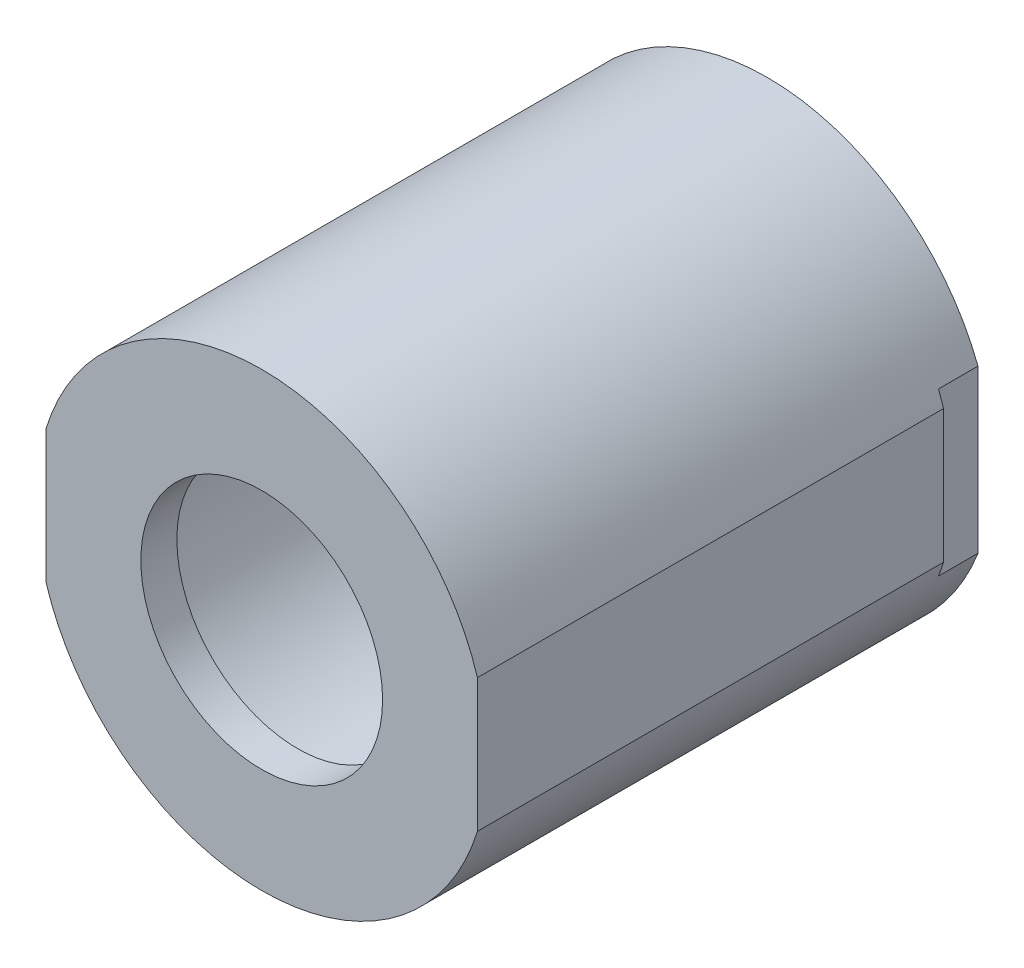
ISO-10303-21;
HEADER;
FILE_DESCRIPTION(('STEP AP214'),'2;1');
FILE_NAME('part.step','',(''),(''),'','','');
FILE_SCHEMA(('AUTOMOTIVE_DESIGN { 1 0 10303 214 1 1 1 1 }'));
ENDSEC;
DATA;
#1=APPLICATION_CONTEXT('core data for automotive mechanical design processes');
#2=APPLICATION_PROTOCOL_DEFINITION('international standard','automotive_design',2000,#1);
#3=PRODUCT_CONTEXT('',#1,'mechanical');
#4=PRODUCT('Part','Part','',(#3));
#5=PRODUCT_RELATED_PRODUCT_CATEGORY('part','',(#4));
#6=PRODUCT_DEFINITION_FORMATION('','',#4);
#7=PRODUCT_DEFINITION_CONTEXT('part definition',#1,'design');
#8=PRODUCT_DEFINITION('design','',#6,#7);
#9=PRODUCT_DEFINITION_SHAPE('','',#8);
#10=(LENGTH_UNIT() NAMED_UNIT(*) SI_UNIT(.MILLI.,.METRE.));
#11=(NAMED_UNIT(*) PLANE_ANGLE_UNIT() SI_UNIT($,.RADIAN.));
#12=(NAMED_UNIT(*) SI_UNIT($,.STERADIAN.) SOLID_ANGLE_UNIT());
#13=UNCERTAINTY_MEASURE_WITH_UNIT(LENGTH_MEASURE(1.E-05),#10,'distance_accuracy_value','');
#14=(GEOMETRIC_REPRESENTATION_CONTEXT(3) GLOBAL_UNCERTAINTY_ASSIGNED_CONTEXT((#13)) GLOBAL_UNIT_ASSIGNED_CONTEXT((#10,
#11,#12)) REPRESENTATION_CONTEXT('',''));
#15=CARTESIAN_POINT('',(0.,0.,0.));
#16=DIRECTION('',(0.,0.,1.));
#17=DIRECTION('',(1.,0.,0.));
#18=AXIS2_PLACEMENT_3D('',#15,#16,#17);
#19=CARTESIAN_POINT('',(27.305,-8.42422696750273,64.));
#20=DIRECTION('',(-1.,0.,0.));
#21=DIRECTION('',(0.,0.,1.));
#22=AXIS2_PLACEMENT_3D('',#19,#20,#21);
#23=PLANE('',#22);
#24=DIRECTION('',(0.,-1.,0.));
#25=VECTOR('',#24,1.);
#26=CARTESIAN_POINT('',(27.305,-8.42422696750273,5.));
#27=LINE('',#26,#25);
#28=CARTESIAN_POINT('',(27.305,8.42422696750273,5.));
#29=VERTEX_POINT('',#28);
#30=CARTESIAN_POINT('',(27.305,-8.42422696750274,5.));
#31=VERTEX_POINT('',#30);
#32=EDGE_CURVE('E11',#29,#31,#27,.T.);
#33=ORIENTED_EDGE('',*,*,#32,.F.);
#34=DIRECTION('',(0.,0.,-1.));
#35=VECTOR('',#34,1.);
#36=CARTESIAN_POINT('',(27.305,8.42422696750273,64.));
#37=LINE('',#36,#35);
#38=CARTESIAN_POINT('',(27.305,8.42422696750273,64.));
#39=VERTEX_POINT('',#38);
#40=EDGE_CURVE('E149',#39,#29,#37,.T.);
#41=ORIENTED_EDGE('',*,*,#40,.F.);
#42=DIRECTION('',(0.,1.,0.));
#43=VECTOR('',#42,1.);
#44=CARTESIAN_POINT('',(27.305,-8.42422696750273,64.));
#45=LINE('',#44,#43);
#46=CARTESIAN_POINT('',(27.305,-8.42422696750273,64.));
#47=VERTEX_POINT('',#46);
#48=EDGE_CURVE('E143',#47,#39,#45,.T.);
#49=ORIENTED_EDGE('',*,*,#48,.F.);
#50=DIRECTION('',(0.,0.,-1.));
#51=VECTOR('',#50,1.);
#52=CARTESIAN_POINT('',(27.305,-8.42422696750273,64.));
#53=LINE('',#52,#51);
#54=EDGE_CURVE('E148',#47,#31,#53,.T.);
#55=ORIENTED_EDGE('',*,*,#54,.T.);
#56=EDGE_LOOP('',(#33,#41,#49,#55));
#57=FACE_BOUND('',#56,.T.);
#58=ADVANCED_FACE('F35',(#57),#23,.F.);
#59=CARTESIAN_POINT('',(-27.305,-8.42422696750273,64.));
#60=DIRECTION('',(1.,0.,0.));
#61=DIRECTION('',(0.,0.,-1.));
#62=AXIS2_PLACEMENT_3D('',#59,#60,#61);
#63=PLANE('',#62);
#64=DIRECTION('',(0.,1.,0.));
#65=VECTOR('',#64,1.);
#66=CARTESIAN_POINT('',(-27.305,-8.42422696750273,5.));
#67=LINE('',#66,#65);
#68=CARTESIAN_POINT('',(-27.305,-8.42422696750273,5.));
#69=VERTEX_POINT('',#68);
#70=CARTESIAN_POINT('',(-27.305,8.42422696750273,5.));
#71=VERTEX_POINT('',#70);
#72=EDGE_CURVE('E43',#69,#71,#67,.T.);
#73=ORIENTED_EDGE('',*,*,#72,.F.);
#74=DIRECTION('',(0.,0.,-1.));
#75=VECTOR('',#74,1.);
#76=CARTESIAN_POINT('',(-27.305,-8.42422696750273,64.));
#77=LINE('',#76,#75);
#78=CARTESIAN_POINT('',(-27.305,-8.42422696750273,64.));
#79=VERTEX_POINT('',#78);
#80=EDGE_CURVE('E140',#79,#69,#77,.T.);
#81=ORIENTED_EDGE('',*,*,#80,.F.);
#82=DIRECTION('',(0.,-1.,0.));
#83=VECTOR('',#82,1.);
#84=CARTESIAN_POINT('',(-27.305,-8.42422696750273,64.));
#85=LINE('',#84,#83);
#86=CARTESIAN_POINT('',(-27.305,8.42422696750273,64.));
#87=VERTEX_POINT('',#86);
#88=EDGE_CURVE('E134',#87,#79,#85,.T.);
#89=ORIENTED_EDGE('',*,*,#88,.F.);
#90=DIRECTION('',(0.,0.,-1.));
#91=VECTOR('',#90,1.);
#92=CARTESIAN_POINT('',(-27.305,8.42422696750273,64.));
#93=LINE('',#92,#91);
#94=EDGE_CURVE('E139',#87,#71,#93,.T.);
#95=ORIENTED_EDGE('',*,*,#94,.T.);
#96=EDGE_LOOP('',(#73,#81,#89,#95));
#97=FACE_BOUND('',#96,.T.);
#98=ADVANCED_FACE('F181',(#97),#63,.F.);
#99=CARTESIAN_POINT('',(0.,0.,64.));
#100=DIRECTION('',(0.,0.,-1.));
#101=DIRECTION('',(-1.,0.,0.));
#102=AXIS2_PLACEMENT_3D('',#99,#100,#101);
#103=CYLINDRICAL_SURFACE('',#102,28.575);
#104=CARTESIAN_POINT('',(0.,0.,0.));
#105=DIRECTION('',(0.,0.,1.));
#106=DIRECTION('',(1.,0.,0.));
#107=AXIS2_PLACEMENT_3D('',#104,#105,#106);
#108=CIRCLE('',#107,28.575);
#109=CARTESIAN_POINT('',(-26.67,-10.2587389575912,0.));
#110=VERTEX_POINT('',#109);
#111=CARTESIAN_POINT('',(26.67,-10.2587389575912,0.));
#112=VERTEX_POINT('',#111);
#113=EDGE_CURVE('E120',#110,#112,#108,.T.);
#114=ORIENTED_EDGE('',*,*,#113,.T.);
#115=DIRECTION('',(0.,0.,-1.));
#116=VECTOR('',#115,1.);
#117=CARTESIAN_POINT('',(26.67,-10.2587389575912,5.));
#118=LINE('',#117,#116);
#119=CARTESIAN_POINT('',(26.67,-10.2587389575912,5.));
#120=VERTEX_POINT('',#119);
#121=EDGE_CURVE('E111',#120,#112,#118,.T.);
#122=ORIENTED_EDGE('',*,*,#121,.F.);
#123=CARTESIAN_POINT('',(0.,0.,5.));
#124=DIRECTION('',(0.,0.,-1.));
#125=DIRECTION('',(-1.,0.,0.));
#126=AXIS2_PLACEMENT_3D('',#123,#124,#125);
#127=CIRCLE('',#126,28.575);
#128=EDGE_CURVE('E99',#31,#120,#127,.T.);
#129=ORIENTED_EDGE('',*,*,#128,.F.);
#130=ORIENTED_EDGE('',*,*,#54,.F.);
#131=CARTESIAN_POINT('',(0.,0.,64.));
#132=DIRECTION('',(0.,0.,1.));
#133=DIRECTION('',(1.,0.,0.));
#134=AXIS2_PLACEMENT_3D('',#131,#132,#133);
#135=CIRCLE('',#134,28.575);
#136=EDGE_CURVE('E171',#79,#47,#135,.T.);
#137=ORIENTED_EDGE('',*,*,#136,.F.);
#138=ORIENTED_EDGE('',*,*,#80,.T.);
#139=CARTESIAN_POINT('',(0.,0.,5.));
#140=DIRECTION('',(0.,0.,-1.));
#141=DIRECTION('',(-1.,0.,0.));
#142=AXIS2_PLACEMENT_3D('',#139,#140,#141);
#143=CIRCLE('',#142,28.575);
#144=CARTESIAN_POINT('',(-26.67,-10.2587389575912,5.));
#145=VERTEX_POINT('',#144);
#146=EDGE_CURVE('E57',#145,#69,#143,.T.);
#147=ORIENTED_EDGE('',*,*,#146,.F.);
#148=DIRECTION('',(0.,0.,-1.));
#149=VECTOR('',#148,1.);
#150=CARTESIAN_POINT('',(-26.67,-10.2587389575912,5.));
#151=LINE('',#150,#149);
#152=EDGE_CURVE('E132',#145,#110,#151,.T.);
#153=ORIENTED_EDGE('',*,*,#152,.T.);
#154=EDGE_LOOP('',(#114,#122,#129,#130,#137,#138,#147,#153));
#155=FACE_BOUND('',#154,.T.);
#156=ADVANCED_FACE('F117',(#155),#103,.T.);
#157=CARTESIAN_POINT('',(0.,0.,-0.001000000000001));
#158=DIRECTION('',(0.,0.,1.));
#159=DIRECTION('',(1.,0.,0.));
#160=AXIS2_PLACEMENT_3D('',#157,#158,#159);
#161=CYLINDRICAL_SURFACE('',#160,15.3);
#162=CARTESIAN_POINT('',(0.,0.,64.));
#163=DIRECTION('',(0.,0.,1.));
#164=DIRECTION('',(1.,0.,0.));
#165=AXIS2_PLACEMENT_3D('',#162,#163,#164);
#166=CIRCLE('',#165,15.3);
#167=CARTESIAN_POINT('',(15.3,0.,64.));
#168=VERTEX_POINT('',#167);
#169=EDGE_CURVE('E163',#168,#168,#166,.T.);
#170=ORIENTED_EDGE('',*,*,#169,.T.);
#171=EDGE_LOOP('',(#170));
#172=FACE_BOUND('',#171,.T.);
#173=CARTESIAN_POINT('',(0.,0.,59.4409163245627));
#174=DIRECTION('',(0.,0.,-1.));
#175=DIRECTION('',(-1.,0.,0.));
#176=AXIS2_PLACEMENT_3D('',#173,#174,#175);
#177=CIRCLE('',#176,15.3);
#178=CARTESIAN_POINT('',(-15.3,0.,59.4409163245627));
#179=VERTEX_POINT('',#178);
#180=EDGE_CURVE('E156',#179,#179,#177,.F.);
#181=ORIENTED_EDGE('',*,*,#180,.F.);
#182=EDGE_LOOP('',(#181));
#183=FACE_BOUND('',#182,.T.);
#184=ADVANCED_FACE('F217',(#172,#183),#161,.F.);
#185=CARTESIAN_POINT('',(0.,0.,59.));
#186=DIRECTION('',(0.,0.,-1.));
#187=DIRECTION('',(-1.,0.,0.));
#188=AXIS2_PLACEMENT_3D('',#185,#186,#187);
#189=PLANE('',#188);
#190=CARTESIAN_POINT('',(0.,0.,59.));
#191=DIRECTION('',(0.,0.,-1.));
#192=DIRECTION('',(-1.,0.,0.));
#193=AXIS2_PLACEMENT_3D('',#190,#191,#192);
#194=CIRCLE('',#193,21.43125);
#195=CARTESIAN_POINT('',(-21.43125,0.,59.));
#196=VERTEX_POINT('',#195);
#197=EDGE_CURVE('E160',#196,#196,#194,.T.);
#198=ORIENTED_EDGE('',*,*,#197,.T.);
#199=EDGE_LOOP('',(#198));
#200=FACE_BOUND('',#199,.T.);
#201=CARTESIAN_POINT('',(0.,0.,59.));
#202=DIRECTION('',(0.,0.,-1.));
#203=DIRECTION('',(-1.,0.,0.));
#204=AXIS2_PLACEMENT_3D('',#201,#202,#203);
#205=CIRCLE('',#204,17.);
#206=CARTESIAN_POINT('',(-17.,0.,59.));
#207=VERTEX_POINT('',#206);
#208=EDGE_CURVE('E152',#207,#207,#205,.T.);
#209=ORIENTED_EDGE('',*,*,#208,.F.);
#210=EDGE_LOOP('',(#209));
#211=FACE_BOUND('',#210,.T.);
#212=ADVANCED_FACE('F214',(#200,#211),#189,.T.);
#213=CARTESIAN_POINT('',(26.67,10.2587389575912,5.));
#214=VERTEX_POINT('',#213);
#215=EDGE_CURVE('E49',#214,#29,#127,.T.);
#216=ORIENTED_EDGE('',*,*,#215,.F.);
#217=DIRECTION('',(0.,0.,-1.));
#218=VECTOR('',#217,1.);
#219=CARTESIAN_POINT('',(26.67,10.2587389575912,5.));
#220=LINE('',#219,#218);
#221=CARTESIAN_POINT('',(26.67,10.2587389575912,0.));
#222=VERTEX_POINT('',#221);
#223=EDGE_CURVE('E114',#214,#222,#220,.T.);
#224=ORIENTED_EDGE('',*,*,#223,.T.);
#225=CARTESIAN_POINT('',(-26.67,10.2587389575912,0.));
#226=VERTEX_POINT('',#225);
#227=EDGE_CURVE('E172',#222,#226,#108,.T.);
#228=ORIENTED_EDGE('',*,*,#227,.T.);
#229=DIRECTION('',(0.,0.,-1.));
#230=VECTOR('',#229,1.);
#231=CARTESIAN_POINT('',(-26.67,10.2587389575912,5.));
#232=LINE('',#231,#230);
#233=CARTESIAN_POINT('',(-26.67,10.2587389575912,5.));
#234=VERTEX_POINT('',#233);
#235=EDGE_CURVE('E130',#234,#226,#232,.T.);
#236=ORIENTED_EDGE('',*,*,#235,.F.);
#237=EDGE_CURVE('E128',#71,#234,#143,.T.);
#238=ORIENTED_EDGE('',*,*,#237,.F.);
#239=ORIENTED_EDGE('',*,*,#94,.F.);
#240=EDGE_CURVE('E168',#39,#87,#135,.T.);
#241=ORIENTED_EDGE('',*,*,#240,.F.);
#242=ORIENTED_EDGE('',*,*,#40,.T.);
#243=EDGE_LOOP('',(#216,#224,#228,#236,#238,#239,#241,#242));
#244=FACE_BOUND('',#243,.T.);
#245=ADVANCED_FACE('F37',(#244),#103,.T.);
#246=CARTESIAN_POINT('',(0.,0.,64.));
#247=DIRECTION('',(0.,0.,1.));
#248=DIRECTION('',(1.,0.,0.));
#249=AXIS2_PLACEMENT_3D('',#246,#247,#248);
#250=PLANE('',#249);
#251=ORIENTED_EDGE('',*,*,#88,.T.);
#252=ORIENTED_EDGE('',*,*,#136,.T.);
#253=ORIENTED_EDGE('',*,*,#48,.T.);
#254=ORIENTED_EDGE('',*,*,#240,.T.);
#255=EDGE_LOOP('',(#251,#252,#253,#254));
#256=FACE_BOUND('',#255,.T.);
#257=ORIENTED_EDGE('',*,*,#169,.F.);
#258=EDGE_LOOP('',(#257));
#259=FACE_BOUND('',#258,.T.);
#260=ADVANCED_FACE('F184',(#256,#259),#250,.T.);
#261=CARTESIAN_POINT('',(0.,0.,0.));
#262=DIRECTION('',(0.,0.,1.));
#263=DIRECTION('',(1.,0.,0.));
#264=AXIS2_PLACEMENT_3D('',#261,#262,#263);
#265=PLANE('',#264);
#266=CARTESIAN_POINT('',(0.,0.,0.));
#267=DIRECTION('',(0.,0.,-1.));
#268=DIRECTION('',(-1.,0.,0.));
#269=AXIS2_PLACEMENT_3D('',#266,#267,#268);
#270=CIRCLE('',#269,21.43125);
#271=CARTESIAN_POINT('',(-21.43125,0.,0.));
#272=VERTEX_POINT('',#271);
#273=EDGE_CURVE('E159',#272,#272,#270,.T.);
#274=ORIENTED_EDGE('',*,*,#273,.F.);
#275=EDGE_LOOP('',(#274));
#276=FACE_BOUND('',#275,.T.);
#277=ORIENTED_EDGE('',*,*,#227,.F.);
#278=DIRECTION('',(0.,1.,0.));
#279=VECTOR('',#278,1.);
#280=CARTESIAN_POINT('',(26.67,10.2587389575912,0.));
#281=LINE('',#280,#279);
#282=EDGE_CURVE('E107',#112,#222,#281,.T.);
#283=ORIENTED_EDGE('',*,*,#282,.F.);
#284=ORIENTED_EDGE('',*,*,#113,.F.);
#285=DIRECTION('',(0.,-1.,0.));
#286=VECTOR('',#285,1.);
#287=CARTESIAN_POINT('',(-26.67,10.2587389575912,0.));
#288=LINE('',#287,#286);
#289=EDGE_CURVE('E122',#226,#110,#288,.T.);
#290=ORIENTED_EDGE('',*,*,#289,.F.);
#291=EDGE_LOOP('',(#277,#283,#284,#290));
#292=FACE_BOUND('',#291,.T.);
#293=ADVANCED_FACE('F190',(#276,#292),#265,.F.);
#294=CARTESIAN_POINT('',(0.,0.,59.));
#295=DIRECTION('',(0.,0.,-1.));
#296=DIRECTION('',(-1.,0.,0.));
#297=AXIS2_PLACEMENT_3D('',#294,#295,#296);
#298=CYLINDRICAL_SURFACE('',#297,21.43125);
#299=ORIENTED_EDGE('',*,*,#197,.F.);
#300=EDGE_LOOP('',(#299));
#301=FACE_BOUND('',#300,.T.);
#302=ORIENTED_EDGE('',*,*,#273,.T.);
#303=EDGE_LOOP('',(#302));
#304=FACE_BOUND('',#303,.T.);
#305=ADVANCED_FACE('F212',(#301,#304),#298,.F.);
#306=CARTESIAN_POINT('',(0.,0.,59.5187250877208));
#307=DIRECTION('',(0.,0.,-1.));
#308=DIRECTION('',(-1.,0.,0.));
#309=AXIS2_PLACEMENT_3D('',#306,#307,#308);
#310=CONICAL_SURFACE('',#309,15.,1.31702545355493);
#311=ORIENTED_EDGE('',*,*,#208,.T.);
#312=EDGE_LOOP('',(#311));
#313=FACE_BOUND('',#312,.T.);
#314=ORIENTED_EDGE('',*,*,#180,.T.);
#315=EDGE_LOOP('',(#314));
#316=FACE_BOUND('',#315,.T.);
#317=ADVANCED_FACE('F201',(#313,#316),#310,.F.);
#318=CARTESIAN_POINT('',(0.,0.,5.));
#319=DIRECTION('',(0.,0.,-1.));
#320=DIRECTION('',(-1.,0.,0.));
#321=AXIS2_PLACEMENT_3D('',#318,#319,#320);
#322=PLANE('',#321);
#323=ORIENTED_EDGE('',*,*,#72,.T.);
#324=ORIENTED_EDGE('',*,*,#237,.T.);
#325=DIRECTION('',(0.,-1.,0.));
#326=VECTOR('',#325,1.);
#327=CARTESIAN_POINT('',(-26.67,10.2587389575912,5.));
#328=LINE('',#327,#326);
#329=EDGE_CURVE('E127',#234,#145,#328,.T.);
#330=ORIENTED_EDGE('',*,*,#329,.T.);
#331=ORIENTED_EDGE('',*,*,#146,.T.);
#332=EDGE_LOOP('',(#323,#324,#330,#331));
#333=FACE_BOUND('',#332,.T.);
#334=ADVANCED_FACE('F174',(#333),#322,.T.);
#335=CARTESIAN_POINT('',(-26.67,10.2587389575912,5.));
#336=DIRECTION('',(1.,0.,0.));
#337=DIRECTION('',(0.,0.,-1.));
#338=AXIS2_PLACEMENT_3D('',#335,#336,#337);
#339=PLANE('',#338);
#340=ORIENTED_EDGE('',*,*,#289,.T.);
#341=ORIENTED_EDGE('',*,*,#152,.F.);
#342=ORIENTED_EDGE('',*,*,#329,.F.);
#343=ORIENTED_EDGE('',*,*,#235,.T.);
#344=EDGE_LOOP('',(#340,#341,#342,#343));
#345=FACE_BOUND('',#344,.T.);
#346=ADVANCED_FACE('F193',(#345),#339,.F.);
#347=CARTESIAN_POINT('',(0.,0.,5.));
#348=DIRECTION('',(0.,0.,-1.));
#349=DIRECTION('',(-1.,0.,0.));
#350=AXIS2_PLACEMENT_3D('',#347,#348,#349);
#351=PLANE('',#350);
#352=ORIENTED_EDGE('',*,*,#32,.T.);
#353=ORIENTED_EDGE('',*,*,#128,.T.);
#354=DIRECTION('',(0.,1.,0.));
#355=VECTOR('',#354,1.);
#356=CARTESIAN_POINT('',(26.67,10.2587389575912,5.));
#357=LINE('',#356,#355);
#358=EDGE_CURVE('E102',#120,#214,#357,.T.);
#359=ORIENTED_EDGE('',*,*,#358,.T.);
#360=ORIENTED_EDGE('',*,*,#215,.T.);
#361=EDGE_LOOP('',(#352,#353,#359,#360));
#362=FACE_BOUND('',#361,.T.);
#363=ADVANCED_FACE('F101',(#362),#351,.T.);
#364=CARTESIAN_POINT('',(26.67,10.2587389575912,5.));
#365=DIRECTION('',(-1.,0.,0.));
#366=DIRECTION('',(0.,0.,1.));
#367=AXIS2_PLACEMENT_3D('',#364,#365,#366);
#368=PLANE('',#367);
#369=ORIENTED_EDGE('',*,*,#282,.T.);
#370=ORIENTED_EDGE('',*,*,#223,.F.);
#371=ORIENTED_EDGE('',*,*,#358,.F.);
#372=ORIENTED_EDGE('',*,*,#121,.T.);
#373=EDGE_LOOP('',(#369,#370,#371,#372));
#374=FACE_BOUND('',#373,.T.);
#375=ADVANCED_FACE('F110',(#374),#368,.F.);
#376=CLOSED_SHELL('',(#58,#98,#156,#184,#212,#245,#260,#293,#305,#317,#334,#346,#363,#375));
#377=MANIFOLD_SOLID_BREP('B2',#376);
#378=ADVANCED_BREP_SHAPE_REPRESENTATION('',(#18,#377),#14);
#379=SHAPE_DEFINITION_REPRESENTATION(#9,#378);
ENDSEC;
END-ISO-10303-21;
